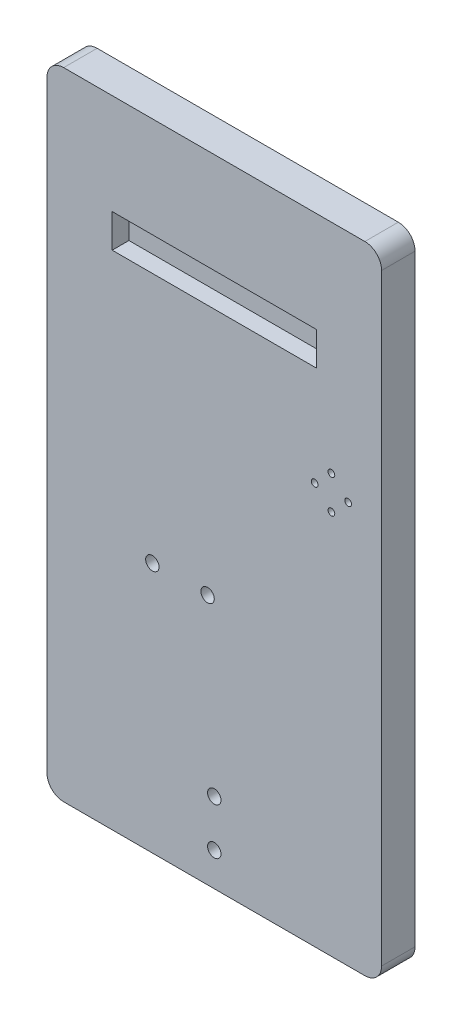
ISO-10303-21;
HEADER;
FILE_DESCRIPTION(('STEP AP214'),'2;1');
FILE_NAME('part.step','',(''),(''),'','','');
FILE_SCHEMA(('AUTOMOTIVE_DESIGN { 1 0 10303 214 1 1 1 1 }'));
ENDSEC;
DATA;
#1=APPLICATION_CONTEXT('core data for automotive mechanical design processes');
#2=APPLICATION_PROTOCOL_DEFINITION('international standard','automotive_design',2000,#1);
#3=PRODUCT_CONTEXT('',#1,'mechanical');
#4=PRODUCT('Part','Part','',(#3));
#5=PRODUCT_RELATED_PRODUCT_CATEGORY('part','',(#4));
#6=PRODUCT_DEFINITION_FORMATION('','',#4);
#7=PRODUCT_DEFINITION_CONTEXT('part definition',#1,'design');
#8=PRODUCT_DEFINITION('design','',#6,#7);
#9=PRODUCT_DEFINITION_SHAPE('','',#8);
#10=(LENGTH_UNIT() NAMED_UNIT(*) SI_UNIT(.MILLI.,.METRE.));
#11=(NAMED_UNIT(*) PLANE_ANGLE_UNIT() SI_UNIT($,.RADIAN.));
#12=(NAMED_UNIT(*) SI_UNIT($,.STERADIAN.) SOLID_ANGLE_UNIT());
#13=UNCERTAINTY_MEASURE_WITH_UNIT(LENGTH_MEASURE(1.E-05),#10,'distance_accuracy_value','');
#14=(GEOMETRIC_REPRESENTATION_CONTEXT(3) GLOBAL_UNCERTAINTY_ASSIGNED_CONTEXT((#13)) GLOBAL_UNIT_ASSIGNED_CONTEXT((#10,
#11,#12)) REPRESENTATION_CONTEXT('',''));
#15=CARTESIAN_POINT('',(0.,0.,0.));
#16=DIRECTION('',(0.,0.,1.));
#17=DIRECTION('',(1.,0.,0.));
#18=AXIS2_PLACEMENT_3D('',#15,#16,#17);
#19=CARTESIAN_POINT('',(-100.,190.,10.));
#20=DIRECTION('',(1.,0.,0.));
#21=DIRECTION('',(0.,1.,0.));
#22=AXIS2_PLACEMENT_3D('',#19,#20,#21);
#23=PLANE('',#22);
#24=DIRECTION('',(0.,-1.,0.));
#25=VECTOR('',#24,1.);
#26=CARTESIAN_POINT('',(-100.,190.,10.));
#27=LINE('',#26,#25);
#28=CARTESIAN_POINT('',(-100.,185.,10.));
#29=VERTEX_POINT('',#28);
#30=CARTESIAN_POINT('',(-100.,5.,10.));
#31=VERTEX_POINT('',#30);
#32=EDGE_CURVE('E167',#29,#31,#27,.T.);
#33=ORIENTED_EDGE('',*,*,#32,.F.);
#34=DIRECTION('',(0.,0.,-1.));
#35=VECTOR('',#34,1.);
#36=CARTESIAN_POINT('',(-100.,185.,10.));
#37=LINE('',#36,#35);
#38=CARTESIAN_POINT('',(-100.,185.,0.));
#39=VERTEX_POINT('',#38);
#40=EDGE_CURVE('E194',#29,#39,#37,.T.);
#41=ORIENTED_EDGE('',*,*,#40,.T.);
#42=DIRECTION('',(0.,-1.,0.));
#43=VECTOR('',#42,1.);
#44=CARTESIAN_POINT('',(-100.,190.,0.));
#45=LINE('',#44,#43);
#46=CARTESIAN_POINT('',(-100.,5.,0.));
#47=VERTEX_POINT('',#46);
#48=EDGE_CURVE('E163',#39,#47,#45,.T.);
#49=ORIENTED_EDGE('',*,*,#48,.T.);
#50=DIRECTION('',(0.,0.,-1.));
#51=VECTOR('',#50,1.);
#52=CARTESIAN_POINT('',(-100.,5.,10.));
#53=LINE('',#52,#51);
#54=EDGE_CURVE('E179',#47,#31,#53,.F.);
#55=ORIENTED_EDGE('',*,*,#54,.T.);
#56=EDGE_LOOP('',(#33,#41,#49,#55));
#57=FACE_BOUND('',#56,.T.);
#58=ADVANCED_FACE('F34',(#57),#23,.F.);
#59=CARTESIAN_POINT('',(-100.,0.,10.));
#60=DIRECTION('',(0.,1.,0.));
#61=DIRECTION('',(0.,0.,1.));
#62=AXIS2_PLACEMENT_3D('',#59,#60,#61);
#63=PLANE('',#62);
#64=DIRECTION('',(1.,0.,0.));
#65=VECTOR('',#64,1.);
#66=CARTESIAN_POINT('',(-100.,0.,0.));
#67=LINE('',#66,#65);
#68=CARTESIAN_POINT('',(-95.,0.,0.));
#69=VERTEX_POINT('',#68);
#70=CARTESIAN_POINT('',(-5.,0.,0.));
#71=VERTEX_POINT('',#70);
#72=EDGE_CURVE('E183',#69,#71,#67,.T.);
#73=ORIENTED_EDGE('',*,*,#72,.T.);
#74=DIRECTION('',(0.,0.,-1.));
#75=VECTOR('',#74,1.);
#76=CARTESIAN_POINT('',(-5.,0.,10.));
#77=LINE('',#76,#75);
#78=CARTESIAN_POINT('',(-5.,0.,10.));
#79=VERTEX_POINT('',#78);
#80=EDGE_CURVE('E11',#71,#79,#77,.F.);
#81=ORIENTED_EDGE('',*,*,#80,.T.);
#82=DIRECTION('',(1.,0.,0.));
#83=VECTOR('',#82,1.);
#84=CARTESIAN_POINT('',(-100.,0.,10.));
#85=LINE('',#84,#83);
#86=CARTESIAN_POINT('',(-95.,0.,10.));
#87=VERTEX_POINT('',#86);
#88=EDGE_CURVE('E170',#87,#79,#85,.T.);
#89=ORIENTED_EDGE('',*,*,#88,.F.);
#90=DIRECTION('',(0.,0.,-1.));
#91=VECTOR('',#90,1.);
#92=CARTESIAN_POINT('',(-95.,0.,10.));
#93=LINE('',#92,#91);
#94=EDGE_CURVE('E42',#87,#69,#93,.T.);
#95=ORIENTED_EDGE('',*,*,#94,.T.);
#96=EDGE_LOOP('',(#73,#81,#89,#95));
#97=FACE_BOUND('',#96,.T.);
#98=ADVANCED_FACE('F227',(#97),#63,.F.);
#99=CARTESIAN_POINT('',(0.,190.,10.));
#100=DIRECTION('',(-1.,0.,0.));
#101=DIRECTION('',(0.,0.,1.));
#102=AXIS2_PLACEMENT_3D('',#99,#100,#101);
#103=PLANE('',#102);
#104=DIRECTION('',(0.,1.,0.));
#105=VECTOR('',#104,1.);
#106=CARTESIAN_POINT('',(0.,190.,0.));
#107=LINE('',#106,#105);
#108=CARTESIAN_POINT('',(0.,5.,0.));
#109=VERTEX_POINT('',#108);
#110=CARTESIAN_POINT('',(0.,185.,0.));
#111=VERTEX_POINT('',#110);
#112=EDGE_CURVE('E187',#109,#111,#107,.T.);
#113=ORIENTED_EDGE('',*,*,#112,.T.);
#114=DIRECTION('',(0.,0.,-1.));
#115=VECTOR('',#114,1.);
#116=CARTESIAN_POINT('',(0.,185.,10.));
#117=LINE('',#116,#115);
#118=CARTESIAN_POINT('',(0.,185.,10.));
#119=VERTEX_POINT('',#118);
#120=EDGE_CURVE('E57',#111,#119,#117,.F.);
#121=ORIENTED_EDGE('',*,*,#120,.T.);
#122=DIRECTION('',(0.,1.,0.));
#123=VECTOR('',#122,1.);
#124=CARTESIAN_POINT('',(0.,190.,10.));
#125=LINE('',#124,#123);
#126=CARTESIAN_POINT('',(0.,5.,10.));
#127=VERTEX_POINT('',#126);
#128=EDGE_CURVE('E174',#127,#119,#125,.T.);
#129=ORIENTED_EDGE('',*,*,#128,.F.);
#130=DIRECTION('',(0.,0.,-1.));
#131=VECTOR('',#130,1.);
#132=CARTESIAN_POINT('',(0.,5.,10.));
#133=LINE('',#132,#131);
#134=EDGE_CURVE('E219',#127,#109,#133,.T.);
#135=ORIENTED_EDGE('',*,*,#134,.T.);
#136=EDGE_LOOP('',(#113,#121,#129,#135));
#137=FACE_BOUND('',#136,.T.);
#138=ADVANCED_FACE('F239',(#137),#103,.F.);
#139=CARTESIAN_POINT('',(-100.,190.,10.));
#140=DIRECTION('',(0.,-1.,0.));
#141=DIRECTION('',(1.,0.,0.));
#142=AXIS2_PLACEMENT_3D('',#139,#140,#141);
#143=PLANE('',#142);
#144=DIRECTION('',(-1.,0.,0.));
#145=VECTOR('',#144,1.);
#146=CARTESIAN_POINT('',(-100.,190.,0.));
#147=LINE('',#146,#145);
#148=CARTESIAN_POINT('',(-5.,190.,0.));
#149=VERTEX_POINT('',#148);
#150=CARTESIAN_POINT('',(-95.,190.,0.));
#151=VERTEX_POINT('',#150);
#152=EDGE_CURVE('E171',#149,#151,#147,.T.);
#153=ORIENTED_EDGE('',*,*,#152,.T.);
#154=DIRECTION('',(0.,0.,-1.));
#155=VECTOR('',#154,1.);
#156=CARTESIAN_POINT('',(-95.,190.,10.));
#157=LINE('',#156,#155);
#158=CARTESIAN_POINT('',(-95.,190.,10.));
#159=VERTEX_POINT('',#158);
#160=EDGE_CURVE('E209',#151,#159,#157,.F.);
#161=ORIENTED_EDGE('',*,*,#160,.T.);
#162=DIRECTION('',(-1.,0.,0.));
#163=VECTOR('',#162,1.);
#164=CARTESIAN_POINT('',(-100.,190.,10.));
#165=LINE('',#164,#163);
#166=CARTESIAN_POINT('',(-5.,190.,10.));
#167=VERTEX_POINT('',#166);
#168=EDGE_CURVE('E176',#167,#159,#165,.T.);
#169=ORIENTED_EDGE('',*,*,#168,.F.);
#170=DIRECTION('',(0.,0.,-1.));
#171=VECTOR('',#170,1.);
#172=CARTESIAN_POINT('',(-5.,190.,10.));
#173=LINE('',#172,#171);
#174=EDGE_CURVE('E206',#167,#149,#173,.T.);
#175=ORIENTED_EDGE('',*,*,#174,.T.);
#176=EDGE_LOOP('',(#153,#161,#169,#175));
#177=FACE_BOUND('',#176,.T.);
#178=ADVANCED_FACE('F249',(#177),#143,.F.);
#179=CARTESIAN_POINT('',(-100.,190.,10.));
#180=DIRECTION('',(0.,0.,1.));
#181=DIRECTION('',(1.,0.,0.));
#182=AXIS2_PLACEMENT_3D('',#179,#180,#181);
#183=PLANE('',#182);
#184=CARTESIAN_POINT('',(-50.,10.,10.));
#185=DIRECTION('',(0.,0.,1.));
#186=DIRECTION('',(1.,0.,0.));
#187=AXIS2_PLACEMENT_3D('',#184,#185,#186);
#188=CIRCLE('',#187,2.);
#189=CARTESIAN_POINT('',(-48.,10.,10.));
#190=VERTEX_POINT('',#189);
#191=EDGE_CURVE('E546',#190,#190,#188,.T.);
#192=ORIENTED_EDGE('',*,*,#191,.F.);
#193=EDGE_LOOP('',(#192));
#194=FACE_BOUND('',#193,.T.);
#195=CARTESIAN_POINT('',(-50.,23.9,10.));
#196=DIRECTION('',(0.,0.,1.));
#197=DIRECTION('',(1.,0.,0.));
#198=AXIS2_PLACEMENT_3D('',#195,#196,#197);
#199=CIRCLE('',#198,2.);
#200=CARTESIAN_POINT('',(-48.,23.9,10.));
#201=VERTEX_POINT('',#200);
#202=EDGE_CURVE('E542',#201,#201,#199,.T.);
#203=ORIENTED_EDGE('',*,*,#202,.F.);
#204=EDGE_LOOP('',(#203));
#205=FACE_BOUND('',#204,.T.);
#206=CARTESIAN_POINT('',(-10.,120.,10.));
#207=DIRECTION('',(0.,0.,1.));
#208=DIRECTION('',(1.,0.,0.));
#209=AXIS2_PLACEMENT_3D('',#206,#207,#208);
#210=CIRCLE('',#209,1.005);
#211=CARTESIAN_POINT('',(-8.995,120.,10.));
#212=VERTEX_POINT('',#211);
#213=EDGE_CURVE('E538',#212,#212,#210,.T.);
#214=ORIENTED_EDGE('',*,*,#213,.F.);
#215=EDGE_LOOP('',(#214));
#216=FACE_BOUND('',#215,.T.);
#217=CARTESIAN_POINT('',(-20.,120.,10.));
#218=DIRECTION('',(0.,0.,1.));
#219=DIRECTION('',(1.,0.,0.));
#220=AXIS2_PLACEMENT_3D('',#217,#218,#219);
#221=CIRCLE('',#220,1.005);
#222=CARTESIAN_POINT('',(-18.995,120.,10.));
#223=VERTEX_POINT('',#222);
#224=EDGE_CURVE('E534',#223,#223,#221,.T.);
#225=ORIENTED_EDGE('',*,*,#224,.F.);
#226=EDGE_LOOP('',(#225));
#227=FACE_BOUND('',#226,.T.);
#228=CARTESIAN_POINT('',(-15.,125.,10.));
#229=DIRECTION('',(0.,0.,1.));
#230=DIRECTION('',(1.,0.,0.));
#231=AXIS2_PLACEMENT_3D('',#228,#229,#230);
#232=CIRCLE('',#231,1.005);
#233=CARTESIAN_POINT('',(-13.995,125.,10.));
#234=VERTEX_POINT('',#233);
#235=EDGE_CURVE('E530',#234,#234,#232,.T.);
#236=ORIENTED_EDGE('',*,*,#235,.F.);
#237=EDGE_LOOP('',(#236));
#238=FACE_BOUND('',#237,.T.);
#239=CARTESIAN_POINT('',(-15.,115.,10.));
#240=DIRECTION('',(0.,0.,1.));
#241=DIRECTION('',(1.,0.,0.));
#242=AXIS2_PLACEMENT_3D('',#239,#240,#241);
#243=CIRCLE('',#242,1.005);
#244=CARTESIAN_POINT('',(-13.995,115.,10.));
#245=VERTEX_POINT('',#244);
#246=EDGE_CURVE('E526',#245,#245,#243,.T.);
#247=ORIENTED_EDGE('',*,*,#246,.F.);
#248=EDGE_LOOP('',(#247));
#249=FACE_BOUND('',#248,.T.);
#250=CARTESIAN_POINT('',(-68.5,75.,10.));
#251=DIRECTION('',(0.,0.,1.));
#252=DIRECTION('',(1.,0.,0.));
#253=AXIS2_PLACEMENT_3D('',#250,#251,#252);
#254=CIRCLE('',#253,2.);
#255=CARTESIAN_POINT('',(-66.5,75.,10.));
#256=VERTEX_POINT('',#255);
#257=EDGE_CURVE('E520',#256,#256,#254,.T.);
#258=ORIENTED_EDGE('',*,*,#257,.F.);
#259=EDGE_LOOP('',(#258));
#260=FACE_BOUND('',#259,.T.);
#261=CARTESIAN_POINT('',(-52.,75.,10.));
#262=DIRECTION('',(0.,0.,1.));
#263=DIRECTION('',(1.,0.,0.));
#264=AXIS2_PLACEMENT_3D('',#261,#262,#263);
#265=CIRCLE('',#264,2.);
#266=CARTESIAN_POINT('',(-50.,75.,10.));
#267=VERTEX_POINT('',#266);
#268=EDGE_CURVE('E150',#267,#267,#265,.T.);
#269=ORIENTED_EDGE('',*,*,#268,.F.);
#270=EDGE_LOOP('',(#269));
#271=FACE_BOUND('',#270,.T.);
#272=DIRECTION('',(0.,-1.,0.));
#273=VECTOR('',#272,1.);
#274=CARTESIAN_POINT('',(-80.5,160.,10.));
#275=LINE('',#274,#273);
#276=CARTESIAN_POINT('',(-80.5,160.,10.));
#277=VERTEX_POINT('',#276);
#278=CARTESIAN_POINT('',(-80.5,150.,10.));
#279=VERTEX_POINT('',#278);
#280=EDGE_CURVE('E49',#277,#279,#275,.T.);
#281=ORIENTED_EDGE('',*,*,#280,.F.);
#282=DIRECTION('',(-1.,0.,0.));
#283=VECTOR('',#282,1.);
#284=CARTESIAN_POINT('',(-80.5,160.,10.));
#285=LINE('',#284,#283);
#286=CARTESIAN_POINT('',(-19.5,160.,10.));
#287=VERTEX_POINT('',#286);
#288=EDGE_CURVE('E144',#287,#277,#285,.T.);
#289=ORIENTED_EDGE('',*,*,#288,.F.);
#290=DIRECTION('',(0.,1.,0.));
#291=VECTOR('',#290,1.);
#292=CARTESIAN_POINT('',(-19.5,160.,10.));
#293=LINE('',#292,#291);
#294=CARTESIAN_POINT('',(-19.5,150.,10.));
#295=VERTEX_POINT('',#294);
#296=EDGE_CURVE('E147',#295,#287,#293,.T.);
#297=ORIENTED_EDGE('',*,*,#296,.F.);
#298=DIRECTION('',(1.,0.,0.));
#299=VECTOR('',#298,1.);
#300=CARTESIAN_POINT('',(-80.5,150.,10.));
#301=LINE('',#300,#299);
#302=EDGE_CURVE('E156',#279,#295,#301,.T.);
#303=ORIENTED_EDGE('',*,*,#302,.F.);
#304=EDGE_LOOP('',(#281,#289,#297,#303));
#305=FACE_BOUND('',#304,.T.);
#306=ORIENTED_EDGE('',*,*,#168,.T.);
#307=CARTESIAN_POINT('',(-95.,185.,10.));
#308=DIRECTION('',(0.,0.,1.));
#309=DIRECTION('',(1.,0.,0.));
#310=AXIS2_PLACEMENT_3D('',#307,#308,#309);
#311=CIRCLE('',#310,5.);
#312=EDGE_CURVE('E217',#159,#29,#311,.T.);
#313=ORIENTED_EDGE('',*,*,#312,.T.);
#314=ORIENTED_EDGE('',*,*,#32,.T.);
#315=CARTESIAN_POINT('',(-95.,5.,10.));
#316=DIRECTION('',(0.,0.,1.));
#317=DIRECTION('',(1.,0.,0.));
#318=AXIS2_PLACEMENT_3D('',#315,#316,#317);
#319=CIRCLE('',#318,5.);
#320=EDGE_CURVE('E211',#31,#87,#319,.T.);
#321=ORIENTED_EDGE('',*,*,#320,.T.);
#322=ORIENTED_EDGE('',*,*,#88,.T.);
#323=CARTESIAN_POINT('',(-5.,5.,10.));
#324=DIRECTION('',(0.,0.,1.));
#325=DIRECTION('',(1.,0.,0.));
#326=AXIS2_PLACEMENT_3D('',#323,#324,#325);
#327=CIRCLE('',#326,5.);
#328=EDGE_CURVE('E213',#79,#127,#327,.T.);
#329=ORIENTED_EDGE('',*,*,#328,.T.);
#330=ORIENTED_EDGE('',*,*,#128,.T.);
#331=CARTESIAN_POINT('',(-5.,185.,10.));
#332=DIRECTION('',(0.,0.,1.));
#333=DIRECTION('',(1.,0.,0.));
#334=AXIS2_PLACEMENT_3D('',#331,#332,#333);
#335=CIRCLE('',#334,5.);
#336=EDGE_CURVE('E215',#119,#167,#335,.T.);
#337=ORIENTED_EDGE('',*,*,#336,.T.);
#338=EDGE_LOOP('',(#306,#313,#314,#321,#322,#329,#330,#337));
#339=FACE_BOUND('',#338,.T.);
#340=ADVANCED_FACE('F242',(#194,#205,#216,#227,#238,#249,#260,#271,#305,#339),#183,.T.);
#341=CARTESIAN_POINT('',(-100.,190.,0.));
#342=DIRECTION('',(0.,0.,1.));
#343=DIRECTION('',(1.,0.,0.));
#344=AXIS2_PLACEMENT_3D('',#341,#342,#343);
#345=PLANE('',#344);
#346=CARTESIAN_POINT('',(-50.,10.,0.));
#347=DIRECTION('',(0.,0.,1.));
#348=DIRECTION('',(1.,0.,0.));
#349=AXIS2_PLACEMENT_3D('',#346,#347,#348);
#350=CIRCLE('',#349,2.);
#351=CARTESIAN_POINT('',(-48.,10.,0.));
#352=VERTEX_POINT('',#351);
#353=EDGE_CURVE('E493',#352,#352,#350,.T.);
#354=ORIENTED_EDGE('',*,*,#353,.T.);
#355=EDGE_LOOP('',(#354));
#356=FACE_BOUND('',#355,.T.);
#357=CARTESIAN_POINT('',(-50.,23.9,0.));
#358=DIRECTION('',(0.,0.,1.));
#359=DIRECTION('',(1.,0.,0.));
#360=AXIS2_PLACEMENT_3D('',#357,#358,#359);
#361=CIRCLE('',#360,2.);
#362=CARTESIAN_POINT('',(-48.,23.9,0.));
#363=VERTEX_POINT('',#362);
#364=EDGE_CURVE('E497',#363,#363,#361,.T.);
#365=ORIENTED_EDGE('',*,*,#364,.T.);
#366=EDGE_LOOP('',(#365));
#367=FACE_BOUND('',#366,.T.);
#368=CARTESIAN_POINT('',(-10.,120.,0.));
#369=DIRECTION('',(0.,0.,1.));
#370=DIRECTION('',(1.,0.,0.));
#371=AXIS2_PLACEMENT_3D('',#368,#369,#370);
#372=CIRCLE('',#371,1.005);
#373=CARTESIAN_POINT('',(-8.995,120.,0.));
#374=VERTEX_POINT('',#373);
#375=EDGE_CURVE('E501',#374,#374,#372,.T.);
#376=ORIENTED_EDGE('',*,*,#375,.T.);
#377=EDGE_LOOP('',(#376));
#378=FACE_BOUND('',#377,.T.);
#379=CARTESIAN_POINT('',(-20.,120.,0.));
#380=DIRECTION('',(0.,0.,1.));
#381=DIRECTION('',(1.,0.,0.));
#382=AXIS2_PLACEMENT_3D('',#379,#380,#381);
#383=CIRCLE('',#382,1.005);
#384=CARTESIAN_POINT('',(-18.995,120.,0.));
#385=VERTEX_POINT('',#384);
#386=EDGE_CURVE('E505',#385,#385,#383,.T.);
#387=ORIENTED_EDGE('',*,*,#386,.T.);
#388=EDGE_LOOP('',(#387));
#389=FACE_BOUND('',#388,.T.);
#390=CARTESIAN_POINT('',(-15.,125.,0.));
#391=DIRECTION('',(0.,0.,1.));
#392=DIRECTION('',(1.,0.,0.));
#393=AXIS2_PLACEMENT_3D('',#390,#391,#392);
#394=CIRCLE('',#393,1.005);
#395=CARTESIAN_POINT('',(-13.995,125.,0.));
#396=VERTEX_POINT('',#395);
#397=EDGE_CURVE('E509',#396,#396,#394,.T.);
#398=ORIENTED_EDGE('',*,*,#397,.T.);
#399=EDGE_LOOP('',(#398));
#400=FACE_BOUND('',#399,.T.);
#401=CARTESIAN_POINT('',(-15.,115.,0.));
#402=DIRECTION('',(0.,0.,1.));
#403=DIRECTION('',(1.,0.,0.));
#404=AXIS2_PLACEMENT_3D('',#401,#402,#403);
#405=CIRCLE('',#404,1.005);
#406=CARTESIAN_POINT('',(-13.995,115.,0.));
#407=VERTEX_POINT('',#406);
#408=EDGE_CURVE('E513',#407,#407,#405,.T.);
#409=ORIENTED_EDGE('',*,*,#408,.T.);
#410=EDGE_LOOP('',(#409));
#411=FACE_BOUND('',#410,.T.);
#412=CARTESIAN_POINT('',(-68.5,75.,0.));
#413=DIRECTION('',(0.,0.,1.));
#414=DIRECTION('',(1.,0.,0.));
#415=AXIS2_PLACEMENT_3D('',#412,#413,#414);
#416=CIRCLE('',#415,2.);
#417=CARTESIAN_POINT('',(-66.5,75.,0.));
#418=VERTEX_POINT('',#417);
#419=EDGE_CURVE('E157',#418,#418,#416,.T.);
#420=ORIENTED_EDGE('',*,*,#419,.T.);
#421=EDGE_LOOP('',(#420));
#422=FACE_BOUND('',#421,.T.);
#423=CARTESIAN_POINT('',(-52.,75.,0.));
#424=DIRECTION('',(0.,0.,1.));
#425=DIRECTION('',(1.,0.,0.));
#426=AXIS2_PLACEMENT_3D('',#423,#424,#425);
#427=CIRCLE('',#426,2.);
#428=CARTESIAN_POINT('',(-50.,75.,0.));
#429=VERTEX_POINT('',#428);
#430=EDGE_CURVE('E519',#429,#429,#427,.T.);
#431=ORIENTED_EDGE('',*,*,#430,.T.);
#432=EDGE_LOOP('',(#431));
#433=FACE_BOUND('',#432,.T.);
#434=ORIENTED_EDGE('',*,*,#48,.F.);
#435=CARTESIAN_POINT('',(-95.,185.,0.));
#436=DIRECTION('',(0.,0.,1.));
#437=DIRECTION('',(1.,0.,0.));
#438=AXIS2_PLACEMENT_3D('',#435,#436,#437);
#439=CIRCLE('',#438,5.);
#440=EDGE_CURVE('E204',#39,#151,#439,.F.);
#441=ORIENTED_EDGE('',*,*,#440,.T.);
#442=ORIENTED_EDGE('',*,*,#152,.F.);
#443=CARTESIAN_POINT('',(-5.,185.,0.));
#444=DIRECTION('',(0.,0.,1.));
#445=DIRECTION('',(1.,0.,0.));
#446=AXIS2_PLACEMENT_3D('',#443,#444,#445);
#447=CIRCLE('',#446,5.);
#448=EDGE_CURVE('E202',#149,#111,#447,.F.);
#449=ORIENTED_EDGE('',*,*,#448,.T.);
#450=ORIENTED_EDGE('',*,*,#112,.F.);
#451=CARTESIAN_POINT('',(-5.,5.,0.));
#452=DIRECTION('',(0.,0.,1.));
#453=DIRECTION('',(1.,0.,0.));
#454=AXIS2_PLACEMENT_3D('',#451,#452,#453);
#455=CIRCLE('',#454,5.);
#456=EDGE_CURVE('E200',#109,#71,#455,.F.);
#457=ORIENTED_EDGE('',*,*,#456,.T.);
#458=ORIENTED_EDGE('',*,*,#72,.F.);
#459=CARTESIAN_POINT('',(-95.,5.,0.));
#460=DIRECTION('',(0.,0.,1.));
#461=DIRECTION('',(1.,0.,0.));
#462=AXIS2_PLACEMENT_3D('',#459,#460,#461);
#463=CIRCLE('',#462,5.);
#464=EDGE_CURVE('E198',#69,#47,#463,.F.);
#465=ORIENTED_EDGE('',*,*,#464,.T.);
#466=EDGE_LOOP('',(#434,#441,#442,#449,#450,#457,#458,#465));
#467=FACE_BOUND('',#466,.T.);
#468=ADVANCED_FACE('F233',(#356,#367,#378,#389,#400,#411,#422,#433,#467),#345,.F.);
#469=CARTESIAN_POINT('',(-95.,185.,10.));
#470=DIRECTION('',(0.,0.,-1.));
#471=DIRECTION('',(-1.,0.,0.));
#472=AXIS2_PLACEMENT_3D('',#469,#470,#471);
#473=CYLINDRICAL_SURFACE('',#472,5.);
#474=ORIENTED_EDGE('',*,*,#312,.F.);
#475=ORIENTED_EDGE('',*,*,#160,.F.);
#476=ORIENTED_EDGE('',*,*,#440,.F.);
#477=ORIENTED_EDGE('',*,*,#40,.F.);
#478=EDGE_LOOP('',(#474,#475,#476,#477));
#479=FACE_BOUND('',#478,.T.);
#480=ADVANCED_FACE('F254',(#479),#473,.T.);
#481=CARTESIAN_POINT('',(-5.,185.,10.));
#482=DIRECTION('',(0.,0.,-1.));
#483=DIRECTION('',(-1.,0.,0.));
#484=AXIS2_PLACEMENT_3D('',#481,#482,#483);
#485=CYLINDRICAL_SURFACE('',#484,5.);
#486=ORIENTED_EDGE('',*,*,#336,.F.);
#487=ORIENTED_EDGE('',*,*,#120,.F.);
#488=ORIENTED_EDGE('',*,*,#448,.F.);
#489=ORIENTED_EDGE('',*,*,#174,.F.);
#490=EDGE_LOOP('',(#486,#487,#488,#489));
#491=FACE_BOUND('',#490,.T.);
#492=ADVANCED_FACE('F246',(#491),#485,.T.);
#493=CARTESIAN_POINT('',(-5.,5.,10.));
#494=DIRECTION('',(0.,0.,-1.));
#495=DIRECTION('',(-1.,0.,0.));
#496=AXIS2_PLACEMENT_3D('',#493,#494,#495);
#497=CYLINDRICAL_SURFACE('',#496,5.);
#498=ORIENTED_EDGE('',*,*,#328,.F.);
#499=ORIENTED_EDGE('',*,*,#80,.F.);
#500=ORIENTED_EDGE('',*,*,#456,.F.);
#501=ORIENTED_EDGE('',*,*,#134,.F.);
#502=EDGE_LOOP('',(#498,#499,#500,#501));
#503=FACE_BOUND('',#502,.T.);
#504=ADVANCED_FACE('F238',(#503),#497,.T.);
#505=CARTESIAN_POINT('',(-95.,5.,10.));
#506=DIRECTION('',(0.,0.,-1.));
#507=DIRECTION('',(-1.,0.,0.));
#508=AXIS2_PLACEMENT_3D('',#505,#506,#507);
#509=CYLINDRICAL_SURFACE('',#508,5.);
#510=ORIENTED_EDGE('',*,*,#320,.F.);
#511=ORIENTED_EDGE('',*,*,#54,.F.);
#512=ORIENTED_EDGE('',*,*,#464,.F.);
#513=ORIENTED_EDGE('',*,*,#94,.F.);
#514=EDGE_LOOP('',(#510,#511,#512,#513));
#515=FACE_BOUND('',#514,.T.);
#516=ADVANCED_FACE('F36',(#515),#509,.T.);
#517=CARTESIAN_POINT('',(-80.5,160.,5.));
#518=DIRECTION('',(-1.,0.,0.));
#519=DIRECTION('',(0.,-1.,0.));
#520=AXIS2_PLACEMENT_3D('',#517,#518,#519);
#521=PLANE('',#520);
#522=ORIENTED_EDGE('',*,*,#280,.T.);
#523=DIRECTION('',(0.,0.,1.));
#524=VECTOR('',#523,1.);
#525=CARTESIAN_POINT('',(-80.5,150.,5.));
#526=LINE('',#525,#524);
#527=CARTESIAN_POINT('',(-80.5,150.,5.));
#528=VERTEX_POINT('',#527);
#529=EDGE_CURVE('E122',#528,#279,#526,.T.);
#530=ORIENTED_EDGE('',*,*,#529,.F.);
#531=DIRECTION('',(0.,-1.,0.));
#532=VECTOR('',#531,1.);
#533=CARTESIAN_POINT('',(-80.5,160.,5.));
#534=LINE('',#533,#532);
#535=CARTESIAN_POINT('',(-80.5,160.,5.));
#536=VERTEX_POINT('',#535);
#537=EDGE_CURVE('E126',#536,#528,#534,.T.);
#538=ORIENTED_EDGE('',*,*,#537,.F.);
#539=DIRECTION('',(0.,0.,1.));
#540=VECTOR('',#539,1.);
#541=CARTESIAN_POINT('',(-80.5,160.,5.));
#542=LINE('',#541,#540);
#543=EDGE_CURVE('E161',#536,#277,#542,.T.);
#544=ORIENTED_EDGE('',*,*,#543,.T.);
#545=EDGE_LOOP('',(#522,#530,#538,#544));
#546=FACE_BOUND('',#545,.T.);
#547=ADVANCED_FACE('F124',(#546),#521,.F.);
#548=CARTESIAN_POINT('',(-80.5,160.,5.));
#549=DIRECTION('',(0.,1.,0.));
#550=DIRECTION('',(0.,0.,1.));
#551=AXIS2_PLACEMENT_3D('',#548,#549,#550);
#552=PLANE('',#551);
#553=ORIENTED_EDGE('',*,*,#288,.T.);
#554=ORIENTED_EDGE('',*,*,#543,.F.);
#555=DIRECTION('',(-1.,0.,0.));
#556=VECTOR('',#555,1.);
#557=CARTESIAN_POINT('',(-80.5,160.,5.));
#558=LINE('',#557,#556);
#559=CARTESIAN_POINT('',(-19.5,160.,5.));
#560=VERTEX_POINT('',#559);
#561=EDGE_CURVE('E132',#560,#536,#558,.T.);
#562=ORIENTED_EDGE('',*,*,#561,.F.);
#563=DIRECTION('',(0.,0.,1.));
#564=VECTOR('',#563,1.);
#565=CARTESIAN_POINT('',(-19.5,160.,5.));
#566=LINE('',#565,#564);
#567=EDGE_CURVE('E164',#560,#287,#566,.T.);
#568=ORIENTED_EDGE('',*,*,#567,.T.);
#569=EDGE_LOOP('',(#553,#554,#562,#568));
#570=FACE_BOUND('',#569,.T.);
#571=ADVANCED_FACE('F263',(#570),#552,.F.);
#572=CARTESIAN_POINT('',(-19.5,160.,5.));
#573=DIRECTION('',(1.,0.,0.));
#574=DIRECTION('',(0.,1.,0.));
#575=AXIS2_PLACEMENT_3D('',#572,#573,#574);
#576=PLANE('',#575);
#577=ORIENTED_EDGE('',*,*,#296,.T.);
#578=ORIENTED_EDGE('',*,*,#567,.F.);
#579=DIRECTION('',(0.,1.,0.));
#580=VECTOR('',#579,1.);
#581=CARTESIAN_POINT('',(-19.5,160.,5.));
#582=LINE('',#581,#580);
#583=CARTESIAN_POINT('',(-19.5,150.,5.));
#584=VERTEX_POINT('',#583);
#585=EDGE_CURVE('E140',#584,#560,#582,.T.);
#586=ORIENTED_EDGE('',*,*,#585,.F.);
#587=DIRECTION('',(0.,0.,1.));
#588=VECTOR('',#587,1.);
#589=CARTESIAN_POINT('',(-19.5,150.,5.));
#590=LINE('',#589,#588);
#591=EDGE_CURVE('E131',#584,#295,#590,.T.);
#592=ORIENTED_EDGE('',*,*,#591,.T.);
#593=EDGE_LOOP('',(#577,#578,#586,#592));
#594=FACE_BOUND('',#593,.T.);
#595=ADVANCED_FACE('F378',(#594),#576,.F.);
#596=CARTESIAN_POINT('',(-80.5,150.,5.));
#597=DIRECTION('',(0.,-1.,0.));
#598=DIRECTION('',(0.,0.,-1.));
#599=AXIS2_PLACEMENT_3D('',#596,#597,#598);
#600=PLANE('',#599);
#601=ORIENTED_EDGE('',*,*,#302,.T.);
#602=ORIENTED_EDGE('',*,*,#591,.F.);
#603=DIRECTION('',(1.,0.,0.));
#604=VECTOR('',#603,1.);
#605=CARTESIAN_POINT('',(-80.5,150.,5.));
#606=LINE('',#605,#604);
#607=EDGE_CURVE('E135',#528,#584,#606,.T.);
#608=ORIENTED_EDGE('',*,*,#607,.F.);
#609=ORIENTED_EDGE('',*,*,#529,.T.);
#610=EDGE_LOOP('',(#601,#602,#608,#609));
#611=FACE_BOUND('',#610,.T.);
#612=ADVANCED_FACE('F136',(#611),#600,.F.);
#613=CARTESIAN_POINT('',(0.,0.,5.));
#614=DIRECTION('',(0.,0.,1.));
#615=DIRECTION('',(1.,0.,0.));
#616=AXIS2_PLACEMENT_3D('',#613,#614,#615);
#617=PLANE('',#616);
#618=ORIENTED_EDGE('',*,*,#537,.T.);
#619=ORIENTED_EDGE('',*,*,#607,.T.);
#620=ORIENTED_EDGE('',*,*,#585,.T.);
#621=ORIENTED_EDGE('',*,*,#561,.T.);
#622=EDGE_LOOP('',(#618,#619,#620,#621));
#623=FACE_BOUND('',#622,.T.);
#624=ADVANCED_FACE('F142',(#623),#617,.T.);
#625=CARTESIAN_POINT('',(-52.,75.,0.));
#626=DIRECTION('',(0.,0.,1.));
#627=DIRECTION('',(1.,0.,0.));
#628=AXIS2_PLACEMENT_3D('',#625,#626,#627);
#629=CYLINDRICAL_SURFACE('',#628,2.);
#630=ORIENTED_EDGE('',*,*,#430,.F.);
#631=EDGE_LOOP('',(#630));
#632=FACE_BOUND('',#631,.T.);
#633=ORIENTED_EDGE('',*,*,#268,.T.);
#634=EDGE_LOOP('',(#633));
#635=FACE_BOUND('',#634,.T.);
#636=ADVANCED_FACE('F301',(#632,#635),#629,.F.);
#637=CARTESIAN_POINT('',(-68.5,75.,0.));
#638=DIRECTION('',(0.,0.,1.));
#639=DIRECTION('',(1.,0.,0.));
#640=AXIS2_PLACEMENT_3D('',#637,#638,#639);
#641=CYLINDRICAL_SURFACE('',#640,2.);
#642=ORIENTED_EDGE('',*,*,#419,.F.);
#643=EDGE_LOOP('',(#642));
#644=FACE_BOUND('',#643,.T.);
#645=ORIENTED_EDGE('',*,*,#257,.T.);
#646=EDGE_LOOP('',(#645));
#647=FACE_BOUND('',#646,.T.);
#648=ADVANCED_FACE('F400',(#644,#647),#641,.F.);
#649=CARTESIAN_POINT('',(-15.,115.,0.));
#650=DIRECTION('',(0.,0.,1.));
#651=DIRECTION('',(1.,0.,0.));
#652=AXIS2_PLACEMENT_3D('',#649,#650,#651);
#653=CYLINDRICAL_SURFACE('',#652,1.005);
#654=ORIENTED_EDGE('',*,*,#408,.F.);
#655=EDGE_LOOP('',(#654));
#656=FACE_BOUND('',#655,.T.);
#657=ORIENTED_EDGE('',*,*,#246,.T.);
#658=EDGE_LOOP('',(#657));
#659=FACE_BOUND('',#658,.T.);
#660=ADVANCED_FACE('F293',(#656,#659),#653,.F.);
#661=CARTESIAN_POINT('',(-15.,125.,0.));
#662=DIRECTION('',(0.,0.,1.));
#663=DIRECTION('',(1.,0.,0.));
#664=AXIS2_PLACEMENT_3D('',#661,#662,#663);
#665=CYLINDRICAL_SURFACE('',#664,1.005);
#666=ORIENTED_EDGE('',*,*,#397,.F.);
#667=EDGE_LOOP('',(#666));
#668=FACE_BOUND('',#667,.T.);
#669=ORIENTED_EDGE('',*,*,#235,.T.);
#670=EDGE_LOOP('',(#669));
#671=FACE_BOUND('',#670,.T.);
#672=ADVANCED_FACE('F417',(#668,#671),#665,.F.);
#673=CARTESIAN_POINT('',(-20.,120.,0.));
#674=DIRECTION('',(0.,0.,1.));
#675=DIRECTION('',(1.,0.,0.));
#676=AXIS2_PLACEMENT_3D('',#673,#674,#675);
#677=CYLINDRICAL_SURFACE('',#676,1.005);
#678=ORIENTED_EDGE('',*,*,#386,.F.);
#679=EDGE_LOOP('',(#678));
#680=FACE_BOUND('',#679,.T.);
#681=ORIENTED_EDGE('',*,*,#224,.T.);
#682=EDGE_LOOP('',(#681));
#683=FACE_BOUND('',#682,.T.);
#684=ADVANCED_FACE('F426',(#680,#683),#677,.F.);
#685=CARTESIAN_POINT('',(-10.,120.,0.));
#686=DIRECTION('',(0.,0.,1.));
#687=DIRECTION('',(1.,0.,0.));
#688=AXIS2_PLACEMENT_3D('',#685,#686,#687);
#689=CYLINDRICAL_SURFACE('',#688,1.005);
#690=ORIENTED_EDGE('',*,*,#375,.F.);
#691=EDGE_LOOP('',(#690));
#692=FACE_BOUND('',#691,.T.);
#693=ORIENTED_EDGE('',*,*,#213,.T.);
#694=EDGE_LOOP('',(#693));
#695=FACE_BOUND('',#694,.T.);
#696=ADVANCED_FACE('F436',(#692,#695),#689,.F.);
#697=CARTESIAN_POINT('',(-50.,23.9,0.));
#698=DIRECTION('',(0.,0.,1.));
#699=DIRECTION('',(1.,0.,0.));
#700=AXIS2_PLACEMENT_3D('',#697,#698,#699);
#701=CYLINDRICAL_SURFACE('',#700,2.);
#702=ORIENTED_EDGE('',*,*,#364,.F.);
#703=EDGE_LOOP('',(#702));
#704=FACE_BOUND('',#703,.T.);
#705=ORIENTED_EDGE('',*,*,#202,.T.);
#706=EDGE_LOOP('',(#705));
#707=FACE_BOUND('',#706,.T.);
#708=ADVANCED_FACE('F445',(#704,#707),#701,.F.);
#709=CARTESIAN_POINT('',(-50.,10.,0.));
#710=DIRECTION('',(0.,0.,1.));
#711=DIRECTION('',(1.,0.,0.));
#712=AXIS2_PLACEMENT_3D('',#709,#710,#711);
#713=CYLINDRICAL_SURFACE('',#712,2.);
#714=ORIENTED_EDGE('',*,*,#353,.F.);
#715=EDGE_LOOP('',(#714));
#716=FACE_BOUND('',#715,.T.);
#717=ORIENTED_EDGE('',*,*,#191,.T.);
#718=EDGE_LOOP('',(#717));
#719=FACE_BOUND('',#718,.T.);
#720=ADVANCED_FACE('F455',(#716,#719),#713,.F.);
#721=CLOSED_SHELL('',(#58,#98,#138,#178,#340,#468,#480,#492,#504,#516,#547,#571,#595,#612,#624,
#636,#648,#660,#672,#684,#696,#708,#720));
#722=MANIFOLD_SOLID_BREP('B2',#721);
#723=ADVANCED_BREP_SHAPE_REPRESENTATION('',(#18,#722),#14);
#724=SHAPE_DEFINITION_REPRESENTATION(#9,#723);
ENDSEC;
END-ISO-10303-21;
